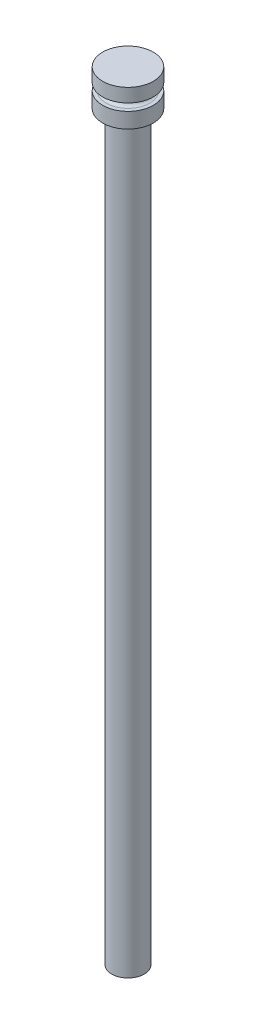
from build123d import *


with BuildPart() as part:
    # Sketch1 → Revolve5 (revolve)
    with BuildSketch(Plane.XY, mode=Mode.PRIVATE) as revolve5_sk:
        with BuildLine():
            Line((0, 0), (14, 0))
            Line((14, 0), (14, -430))
            Line((14, -430), (5, -430))
            Line((5, -430), (5, -20))
            Line((5, -20), (0, -20))
            Line((0, -20), (0, -11.5))
            Line((0, -11.5), (2, -11.5))
            ThreePointArc((2, -11.5), (4, -9.5), (2, -7.5))
            Line((2, -7.5), (0, -7.5))
            Line((0, -7.5), (0, 0))
        make_face()
    revolve(revolve5_sk.sketch.rotate(Axis((14, 0, 0), (0, -1, 0)), 270), axis=Axis((14, 0, 0), (0, -1, 0)))


solid = part.part
